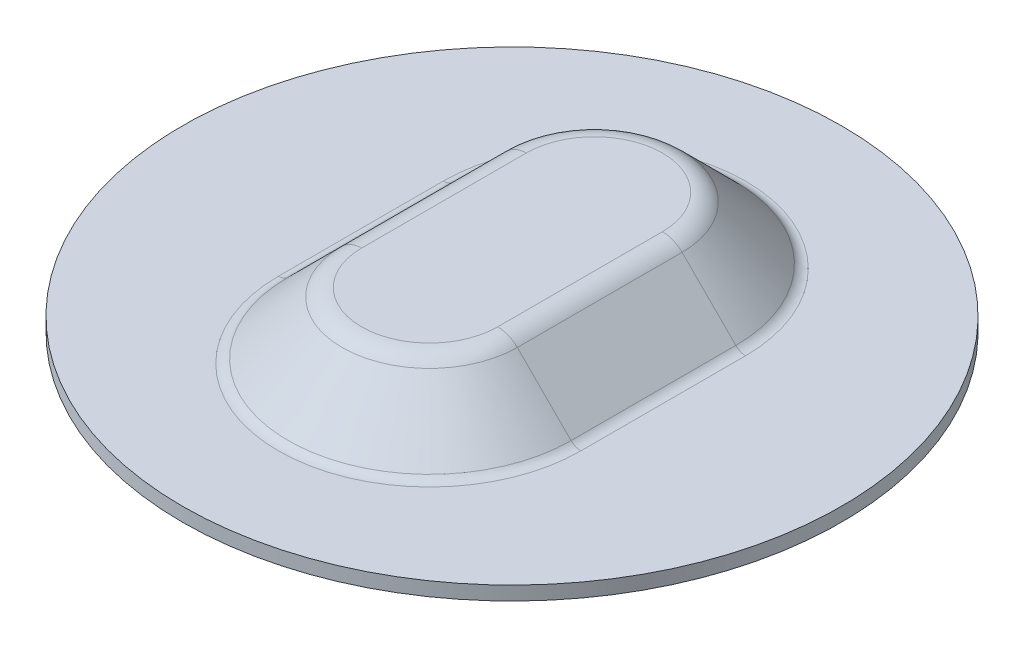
ISO-10303-21;
HEADER;
FILE_DESCRIPTION(('STEP AP214'),'2;1');
FILE_NAME('part.step','',(''),(''),'','','');
FILE_SCHEMA(('AUTOMOTIVE_DESIGN { 1 0 10303 214 1 1 1 1 }'));
ENDSEC;
DATA;
#1=APPLICATION_CONTEXT('core data for automotive mechanical design processes');
#2=APPLICATION_PROTOCOL_DEFINITION('international standard','automotive_design',2000,#1);
#3=PRODUCT_CONTEXT('',#1,'mechanical');
#4=PRODUCT('Part','Part','',(#3));
#5=PRODUCT_RELATED_PRODUCT_CATEGORY('part','',(#4));
#6=PRODUCT_DEFINITION_FORMATION('','',#4);
#7=PRODUCT_DEFINITION_CONTEXT('part definition',#1,'design');
#8=PRODUCT_DEFINITION('design','',#6,#7);
#9=PRODUCT_DEFINITION_SHAPE('','',#8);
#10=(LENGTH_UNIT() NAMED_UNIT(*) SI_UNIT(.MILLI.,.METRE.));
#11=(NAMED_UNIT(*) PLANE_ANGLE_UNIT() SI_UNIT($,.RADIAN.));
#12=(NAMED_UNIT(*) SI_UNIT($,.STERADIAN.) SOLID_ANGLE_UNIT());
#13=UNCERTAINTY_MEASURE_WITH_UNIT(LENGTH_MEASURE(1.E-05),#10,'distance_accuracy_value','');
#14=(GEOMETRIC_REPRESENTATION_CONTEXT(3) GLOBAL_UNCERTAINTY_ASSIGNED_CONTEXT((#13)) GLOBAL_UNIT_ASSIGNED_CONTEXT((#10,
#11,#12)) REPRESENTATION_CONTEXT('',''));
#15=CARTESIAN_POINT('',(0.,0.,0.));
#16=DIRECTION('',(0.,0.,1.));
#17=DIRECTION('',(1.,0.,0.));
#18=AXIS2_PLACEMENT_3D('',#15,#16,#17);
#19=CARTESIAN_POINT('',(0.,0.,-1.53409001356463));
#20=DIRECTION('',(0.,1.,0.));
#21=DIRECTION('',(0.,0.,1.));
#22=AXIS2_PLACEMENT_3D('',#19,#20,#21);
#23=PLANE('',#22);
#24=CARTESIAN_POINT('',(0.,0.,-1.53409001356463));
#25=DIRECTION('',(0.,-1.,0.));
#26=DIRECTION('',(1.,0.,0.));
#27=AXIS2_PLACEMENT_3D('',#24,#25,#26);
#28=CIRCLE('',#27,5.25033394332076);
#29=CARTESIAN_POINT('',(5.25033394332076,0.,-1.53409001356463));
#30=VERTEX_POINT('',#29);
#31=CARTESIAN_POINT('',(0.,0.,3.71624392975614));
#32=VERTEX_POINT('',#31);
#33=EDGE_CURVE('E160',#30,#32,#28,.T.);
#34=ORIENTED_EDGE('',*,*,#33,.F.);
#35=DIRECTION('',(0.,0.,-1.));
#36=VECTOR('',#35,1.);
#37=CARTESIAN_POINT('',(5.25033394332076,0.,-1.53409001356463));
#38=LINE('',#37,#36);
#39=CARTESIAN_POINT('',(5.25033394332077,0.,-14.2340900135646));
#40=VERTEX_POINT('',#39);
#41=EDGE_CURVE('E158',#40,#30,#38,.F.);
#42=ORIENTED_EDGE('',*,*,#41,.F.);
#43=CARTESIAN_POINT('',(0.,0.,-14.2340900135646));
#44=DIRECTION('',(0.,-1.,0.));
#45=DIRECTION('',(-1.,0.,0.));
#46=AXIS2_PLACEMENT_3D('',#43,#44,#45);
#47=CIRCLE('',#46,5.25033394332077);
#48=CARTESIAN_POINT('',(-5.25033394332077,0.,-14.2340900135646));
#49=VERTEX_POINT('',#48);
#50=EDGE_CURVE('E143',#49,#40,#47,.T.);
#51=ORIENTED_EDGE('',*,*,#50,.F.);
#52=DIRECTION('',(0.,0.,1.));
#53=VECTOR('',#52,1.);
#54=CARTESIAN_POINT('',(-5.25033394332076,0.,-1.53409001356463));
#55=LINE('',#54,#53);
#56=CARTESIAN_POINT('',(-5.25033394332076,0.,-1.53409001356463));
#57=VERTEX_POINT('',#56);
#58=EDGE_CURVE('E202',#57,#49,#55,.F.);
#59=ORIENTED_EDGE('',*,*,#58,.F.);
#60=CARTESIAN_POINT('',(0.,0.,-1.53409001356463));
#61=DIRECTION('',(0.,-1.,0.));
#62=DIRECTION('',(0.,0.,1.));
#63=AXIS2_PLACEMENT_3D('',#60,#61,#62);
#64=CIRCLE('',#63,5.25033394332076);
#65=EDGE_CURVE('E208',#32,#57,#64,.T.);
#66=ORIENTED_EDGE('',*,*,#65,.F.);
#67=EDGE_LOOP('',(#34,#42,#51,#59,#66));
#68=FACE_BOUND('',#67,.T.);
#69=ADVANCED_FACE('F18',(#68),#23,.T.);
#70=CARTESIAN_POINT('',(0.,-2.1336,-14.2340900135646));
#71=DIRECTION('',(0.,1.,0.));
#72=DIRECTION('',(0.,0.,1.));
#73=AXIS2_PLACEMENT_3D('',#70,#71,#72);
#74=TOROIDAL_SURFACE('',#73,5.25033394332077,2.1336);
#75=CARTESIAN_POINT('',(-5.25033394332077,-2.1336,-14.2340900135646));
#76=DIRECTION('',(0.,0.,1.));
#77=DIRECTION('',(1.,0.,0.));
#78=AXIS2_PLACEMENT_3D('',#75,#76,#77);
#79=CIRCLE('',#78,2.1336);
#80=CARTESIAN_POINT('',(-6.75901697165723,-0.624916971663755,-14.2340900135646));
#81=VERTEX_POINT('',#80);
#82=EDGE_CURVE('E151',#49,#81,#79,.T.);
#83=ORIENTED_EDGE('',*,*,#82,.F.);
#84=ORIENTED_EDGE('',*,*,#50,.T.);
#85=CARTESIAN_POINT('',(5.25033394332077,-2.1336,-14.2340900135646));
#86=DIRECTION('',(0.,0.,-1.));
#87=DIRECTION('',(-1.,0.,0.));
#88=AXIS2_PLACEMENT_3D('',#85,#86,#87);
#89=CIRCLE('',#88,2.1336);
#90=CARTESIAN_POINT('',(6.75901697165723,-0.624916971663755,-14.2340900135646));
#91=VERTEX_POINT('',#90);
#92=EDGE_CURVE('E148',#91,#40,#89,.F.);
#93=ORIENTED_EDGE('',*,*,#92,.F.);
#94=CARTESIAN_POINT('',(0.,-0.624916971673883,-14.2340900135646));
#95=DIRECTION('',(0.,-1.,0.));
#96=DIRECTION('',(0.,0.,1.));
#97=AXIS2_PLACEMENT_3D('',#94,#95,#96);
#98=CIRCLE('',#97,6.75901697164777);
#99=EDGE_CURVE('E165',#81,#91,#98,.T.);
#100=ORIENTED_EDGE('',*,*,#99,.F.);
#101=EDGE_LOOP('',(#83,#84,#93,#100));
#102=FACE_BOUND('',#101,.T.);
#103=ADVANCED_FACE('F146',(#102),#74,.T.);
#104=CARTESIAN_POINT('',(-5.25033394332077,-2.1336,-1.53409001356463));
#105=DIRECTION('',(0.,0.,1.));
#106=DIRECTION('',(1.,0.,0.));
#107=AXIS2_PLACEMENT_3D('',#104,#105,#106);
#108=CYLINDRICAL_SURFACE('',#107,2.1336);
#109=CARTESIAN_POINT('',(-5.25033394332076,-2.1336,-1.53409001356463));
#110=DIRECTION('',(0.,0.,1.));
#111=DIRECTION('',(-1.,0.,0.));
#112=AXIS2_PLACEMENT_3D('',#109,#110,#111);
#113=CIRCLE('',#112,2.1336);
#114=CARTESIAN_POINT('',(-6.75901697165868,-0.624916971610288,-1.53409001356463));
#115=VERTEX_POINT('',#114);
#116=EDGE_CURVE('E213',#57,#115,#113,.T.);
#117=ORIENTED_EDGE('',*,*,#116,.F.);
#118=ORIENTED_EDGE('',*,*,#58,.T.);
#119=ORIENTED_EDGE('',*,*,#82,.T.);
#120=DIRECTION('',(0.,0.,1.));
#121=VECTOR('',#120,1.);
#122=CARTESIAN_POINT('',(-6.75901697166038,-0.624916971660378,-14.2340900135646));
#123=LINE('',#122,#121);
#124=EDGE_CURVE('E181',#115,#81,#123,.F.);
#125=ORIENTED_EDGE('',*,*,#124,.F.);
#126=EDGE_LOOP('',(#117,#118,#119,#125));
#127=FACE_BOUND('',#126,.T.);
#128=ADVANCED_FACE('F192',(#127),#108,.T.);
#129=CARTESIAN_POINT('',(0.,-2.1336,-1.53409001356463));
#130=DIRECTION('',(0.,1.,0.));
#131=DIRECTION('',(0.,0.,1.));
#132=AXIS2_PLACEMENT_3D('',#129,#130,#131);
#133=TOROIDAL_SURFACE('',#132,5.25033394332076,2.1336);
#134=CARTESIAN_POINT('',(5.25033394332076,-2.1336,-1.53409001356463));
#135=DIRECTION('',(0.,0.,-1.));
#136=DIRECTION('',(-1.,0.,0.));
#137=AXIS2_PLACEMENT_3D('',#134,#135,#136);
#138=CIRCLE('',#137,2.1336);
#139=CARTESIAN_POINT('',(6.75901697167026,-0.624916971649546,-1.53409001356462));
#140=VERTEX_POINT('',#139);
#141=EDGE_CURVE('E172',#30,#140,#138,.T.);
#142=ORIENTED_EDGE('',*,*,#141,.F.);
#143=ORIENTED_EDGE('',*,*,#33,.T.);
#144=ORIENTED_EDGE('',*,*,#65,.T.);
#145=ORIENTED_EDGE('',*,*,#116,.T.);
#146=CARTESIAN_POINT('',(0.,-0.62491697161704,-1.53409001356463));
#147=DIRECTION('',(0.,-1.,0.));
#148=DIRECTION('',(0.,0.,1.));
#149=AXIS2_PLACEMENT_3D('',#146,#147,#148);
#150=CIRCLE('',#149,6.75901697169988);
#151=EDGE_CURVE('E502',#140,#115,#150,.T.);
#152=ORIENTED_EDGE('',*,*,#151,.F.);
#153=EDGE_LOOP('',(#142,#143,#144,#145,#152));
#154=FACE_BOUND('',#153,.T.);
#155=ADVANCED_FACE('F187',(#154),#133,.T.);
#156=CARTESIAN_POINT('',(5.25033394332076,-2.1336,-1.53409001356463));
#157=DIRECTION('',(0.,0.,-1.));
#158=DIRECTION('',(-1.,0.,0.));
#159=AXIS2_PLACEMENT_3D('',#156,#157,#158);
#160=CYLINDRICAL_SURFACE('',#159,2.1336);
#161=ORIENTED_EDGE('',*,*,#92,.T.);
#162=ORIENTED_EDGE('',*,*,#41,.T.);
#163=ORIENTED_EDGE('',*,*,#141,.T.);
#164=DIRECTION('',(0.,0.,1.));
#165=VECTOR('',#164,1.);
#166=CARTESIAN_POINT('',(6.75901697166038,-0.62491697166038,-14.2340900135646));
#167=LINE('',#166,#165);
#168=EDGE_CURVE('E170',#91,#140,#167,.T.);
#169=ORIENTED_EDGE('',*,*,#168,.F.);
#170=EDGE_LOOP('',(#161,#162,#163,#169));
#171=FACE_BOUND('',#170,.T.);
#172=ADVANCED_FACE('F168',(#171),#160,.T.);
#173=CARTESIAN_POINT('',(0.,-1.0668,-1.53409001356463));
#174=DIRECTION('',(0.,1.,0.));
#175=DIRECTION('',(0.,0.,1.));
#176=AXIS2_PLACEMENT_3D('',#173,#174,#175);
#177=PLANE('',#176);
#178=DIRECTION('',(0.,0.,-1.));
#179=VECTOR('',#178,1.);
#180=CARTESIAN_POINT('',(5.25033394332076,-1.0668,-1.53409001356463));
#181=LINE('',#180,#179);
#182=CARTESIAN_POINT('',(5.25033394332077,-1.0668,-14.2340900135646));
#183=VERTEX_POINT('',#182);
#184=CARTESIAN_POINT('',(5.25033394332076,-1.0668,-1.53409001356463));
#185=VERTEX_POINT('',#184);
#186=EDGE_CURVE('E545',#183,#185,#181,.F.);
#187=ORIENTED_EDGE('',*,*,#186,.T.);
#188=CARTESIAN_POINT('',(0.,-1.0668,-1.53409001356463));
#189=DIRECTION('',(0.,1.,0.));
#190=DIRECTION('',(0.,0.,1.));
#191=AXIS2_PLACEMENT_3D('',#188,#189,#190);
#192=CIRCLE('',#191,5.25033394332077);
#193=CARTESIAN_POINT('',(0.,-1.0668,3.71624392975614));
#194=VERTEX_POINT('',#193);
#195=EDGE_CURVE('E592',#185,#194,#192,.F.);
#196=ORIENTED_EDGE('',*,*,#195,.T.);
#197=CARTESIAN_POINT('',(0.,-1.0668,-1.53409001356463));
#198=DIRECTION('',(0.,1.,0.));
#199=DIRECTION('',(-1.,0.,0.));
#200=AXIS2_PLACEMENT_3D('',#197,#198,#199);
#201=CIRCLE('',#200,5.25033394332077);
#202=CARTESIAN_POINT('',(-5.25033394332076,-1.0668,-1.53409001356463));
#203=VERTEX_POINT('',#202);
#204=EDGE_CURVE('E458',#194,#203,#201,.F.);
#205=ORIENTED_EDGE('',*,*,#204,.T.);
#206=DIRECTION('',(0.,0.,1.));
#207=VECTOR('',#206,1.);
#208=CARTESIAN_POINT('',(-5.25033394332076,-1.0668,-1.53409001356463));
#209=LINE('',#208,#207);
#210=CARTESIAN_POINT('',(-5.25033394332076,-1.0668,-14.2340900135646));
#211=VERTEX_POINT('',#210);
#212=EDGE_CURVE('E547',#203,#211,#209,.F.);
#213=ORIENTED_EDGE('',*,*,#212,.T.);
#214=CARTESIAN_POINT('',(0.,-1.0668,-14.2340900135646));
#215=DIRECTION('',(0.,1.,0.));
#216=DIRECTION('',(1.,0.,0.));
#217=AXIS2_PLACEMENT_3D('',#214,#215,#216);
#218=CIRCLE('',#217,5.25033394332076);
#219=EDGE_CURVE('E543',#211,#183,#218,.F.);
#220=ORIENTED_EDGE('',*,*,#219,.T.);
#221=EDGE_LOOP('',(#187,#196,#205,#213,#220));
#222=FACE_BOUND('',#221,.T.);
#223=ADVANCED_FACE('F517',(#222),#177,.F.);
#224=CARTESIAN_POINT('',(0.,-4.76754151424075,-14.2340900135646));
#225=DIRECTION('',(0.,-1.,0.));
#226=DIRECTION('',(0.,0.,-1.));
#227=AXIS2_PLACEMENT_3D('',#224,#225,#226);
#228=CONICAL_SURFACE('',#227,10.9016415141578,0.785398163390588);
#229=DIRECTION('',(-0.707106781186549,0.707106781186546,0.));
#230=VECTOR('',#229,1.);
#231=CARTESIAN_POINT('',(6.1341,0.,-14.2340900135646));
#232=LINE('',#231,#230);
#233=CARTESIAN_POINT('',(10.9016415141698,-4.76754151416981,-14.2340900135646));
#234=VERTEX_POINT('',#233);
#235=EDGE_CURVE('E576',#234,#91,#232,.T.);
#236=ORIENTED_EDGE('',*,*,#235,.F.);
#237=CARTESIAN_POINT('',(0.,-4.76754151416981,-14.2340900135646));
#238=DIRECTION('',(0.,-1.,0.));
#239=DIRECTION('',(0.,0.,-1.));
#240=AXIS2_PLACEMENT_3D('',#237,#238,#239);
#241=CIRCLE('',#240,10.9016415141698);
#242=CARTESIAN_POINT('',(-10.9016415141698,-4.76754151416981,-14.2340900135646));
#243=VERTEX_POINT('',#242);
#244=EDGE_CURVE('E588',#234,#243,#241,.F.);
#245=ORIENTED_EDGE('',*,*,#244,.T.);
#246=DIRECTION('',(-0.707106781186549,-0.707106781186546,0.));
#247=VECTOR('',#246,1.);
#248=CARTESIAN_POINT('',(-6.1341,0.,-14.2340900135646));
#249=LINE('',#248,#247);
#250=EDGE_CURVE('E497',#81,#243,#249,.T.);
#251=ORIENTED_EDGE('',*,*,#250,.F.);
#252=ORIENTED_EDGE('',*,*,#99,.T.);
#253=EDGE_LOOP('',(#236,#245,#251,#252));
#254=FACE_BOUND('',#253,.T.);
#255=ADVANCED_FACE('F526',(#254),#228,.T.);
#256=CARTESIAN_POINT('',(-6.1341,0.,-14.2340900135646));
#257=DIRECTION('',(-0.707106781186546,0.707106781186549,0.));
#258=DIRECTION('',(-0.707106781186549,-0.707106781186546,0.));
#259=AXIS2_PLACEMENT_3D('',#256,#257,#258);
#260=PLANE('',#259);
#261=ORIENTED_EDGE('',*,*,#250,.T.);
#262=DIRECTION('',(0.,0.,1.));
#263=VECTOR('',#262,1.);
#264=CARTESIAN_POINT('',(-10.9016415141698,-4.76754151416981,-14.2340900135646));
#265=LINE('',#264,#263);
#266=CARTESIAN_POINT('',(-10.9016415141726,-4.76754151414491,-1.53409001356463));
#267=VERTEX_POINT('',#266);
#268=EDGE_CURVE('E426',#243,#267,#265,.T.);
#269=ORIENTED_EDGE('',*,*,#268,.T.);
#270=DIRECTION('',(0.707106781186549,0.707106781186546,0.));
#271=VECTOR('',#270,1.);
#272=CARTESIAN_POINT('',(-499001.534090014,-498995.399990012,-1.53409001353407));
#273=LINE('',#272,#271);
#274=EDGE_CURVE('E498',#115,#267,#273,.F.);
#275=ORIENTED_EDGE('',*,*,#274,.F.);
#276=ORIENTED_EDGE('',*,*,#124,.T.);
#277=EDGE_LOOP('',(#261,#269,#275,#276));
#278=FACE_BOUND('',#277,.T.);
#279=ADVANCED_FACE('F739',(#278),#260,.T.);
#280=CARTESIAN_POINT('',(0.,-4.76754151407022,-1.53409001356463));
#281=DIRECTION('',(0.,-1.,0.));
#282=DIRECTION('',(0.,0.,-1.));
#283=AXIS2_PLACEMENT_3D('',#280,#281,#282);
#284=CONICAL_SURFACE('',#283,10.9016415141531,0.785398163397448);
#285=CARTESIAN_POINT('',(0.,-4.76754151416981,-1.53409001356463));
#286=DIRECTION('',(0.,-1.,0.));
#287=DIRECTION('',(0.,0.,-1.));
#288=AXIS2_PLACEMENT_3D('',#285,#286,#287);
#289=CIRCLE('',#288,10.9016415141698);
#290=CARTESIAN_POINT('',(10.9016415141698,-4.76754151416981,-1.53409001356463));
#291=VERTEX_POINT('',#290);
#292=EDGE_CURVE('E420',#267,#291,#289,.F.);
#293=ORIENTED_EDGE('',*,*,#292,.T.);
#294=DIRECTION('',(-0.707106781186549,0.707106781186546,0.));
#295=VECTOR('',#294,1.);
#296=CARTESIAN_POINT('',(6.1341,0.,-1.53409001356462));
#297=LINE('',#296,#295);
#298=EDGE_CURVE('E558',#140,#291,#297,.F.);
#299=ORIENTED_EDGE('',*,*,#298,.F.);
#300=ORIENTED_EDGE('',*,*,#151,.T.);
#301=ORIENTED_EDGE('',*,*,#274,.T.);
#302=EDGE_LOOP('',(#293,#299,#300,#301));
#303=FACE_BOUND('',#302,.T.);
#304=ADVANCED_FACE('F736',(#303),#284,.T.);
#305=CARTESIAN_POINT('',(6.1341,0.,-14.2340900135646));
#306=DIRECTION('',(0.707106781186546,0.707106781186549,0.));
#307=DIRECTION('',(-0.707106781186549,0.707106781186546,0.));
#308=AXIS2_PLACEMENT_3D('',#305,#306,#307);
#309=PLANE('',#308);
#310=ORIENTED_EDGE('',*,*,#298,.T.);
#311=DIRECTION('',(0.,0.,-1.));
#312=VECTOR('',#311,1.);
#313=CARTESIAN_POINT('',(10.9016415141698,-4.76754151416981,-14.2340900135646));
#314=LINE('',#313,#312);
#315=EDGE_CURVE('E387',#291,#234,#314,.T.);
#316=ORIENTED_EDGE('',*,*,#315,.T.);
#317=ORIENTED_EDGE('',*,*,#235,.T.);
#318=ORIENTED_EDGE('',*,*,#168,.T.);
#319=EDGE_LOOP('',(#310,#316,#317,#318));
#320=FACE_BOUND('',#319,.T.);
#321=ADVANCED_FACE('F733',(#320),#309,.T.);
#322=CARTESIAN_POINT('',(5.25033394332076,-2.1336,-1.53409001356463));
#323=DIRECTION('',(0.,0.,-1.));
#324=DIRECTION('',(-1.,0.,0.));
#325=AXIS2_PLACEMENT_3D('',#322,#323,#324);
#326=CYLINDRICAL_SURFACE('',#325,1.0668);
#327=ORIENTED_EDGE('',*,*,#186,.F.);
#328=CARTESIAN_POINT('',(5.25033394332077,-2.1336,-14.2340900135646));
#329=DIRECTION('',(0.,0.,-1.));
#330=DIRECTION('',(1.,0.,0.));
#331=AXIS2_PLACEMENT_3D('',#328,#329,#330);
#332=CIRCLE('',#331,1.0668);
#333=CARTESIAN_POINT('',(6.00467545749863,-1.37925848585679,-14.2340900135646));
#334=VERTEX_POINT('',#333);
#335=EDGE_CURVE('E552',#183,#334,#332,.T.);
#336=ORIENTED_EDGE('',*,*,#335,.T.);
#337=DIRECTION('',(0.,0.,1.));
#338=VECTOR('',#337,1.);
#339=CARTESIAN_POINT('',(6.00467545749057,-1.37925848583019,-14.2340900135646));
#340=LINE('',#339,#338);
#341=CARTESIAN_POINT('',(6.00467545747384,-1.37925848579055,-1.53409001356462));
#342=VERTEX_POINT('',#341);
#343=EDGE_CURVE('E393',#334,#342,#340,.T.);
#344=ORIENTED_EDGE('',*,*,#343,.T.);
#345=CARTESIAN_POINT('',(5.25033394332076,-2.1336,-1.53409001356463));
#346=DIRECTION('',(0.,0.,-1.));
#347=DIRECTION('',(1.,0.,0.));
#348=AXIS2_PLACEMENT_3D('',#345,#346,#347);
#349=CIRCLE('',#348,1.0668);
#350=EDGE_CURVE('E557',#342,#185,#349,.F.);
#351=ORIENTED_EDGE('',*,*,#350,.T.);
#352=EDGE_LOOP('',(#327,#336,#344,#351));
#353=FACE_BOUND('',#352,.T.);
#354=ADVANCED_FACE('F554',(#353),#326,.F.);
#355=CARTESIAN_POINT('',(0.,-2.1336,-14.2340900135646));
#356=DIRECTION('',(0.,1.,0.));
#357=DIRECTION('',(0.,0.,1.));
#358=AXIS2_PLACEMENT_3D('',#355,#356,#357);
#359=TOROIDAL_SURFACE('',#358,5.25033394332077,1.0668);
#360=ORIENTED_EDGE('',*,*,#219,.F.);
#361=CARTESIAN_POINT('',(-5.25033394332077,-2.1336,-14.2340900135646));
#362=DIRECTION('',(0.,0.,1.));
#363=DIRECTION('',(1.,0.,0.));
#364=AXIS2_PLACEMENT_3D('',#361,#362,#363);
#365=CIRCLE('',#364,1.0668);
#366=CARTESIAN_POINT('',(-6.00467545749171,-1.37925848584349,-14.2340900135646));
#367=VERTEX_POINT('',#366);
#368=EDGE_CURVE('E564',#211,#367,#365,.T.);
#369=ORIENTED_EDGE('',*,*,#368,.T.);
#370=CARTESIAN_POINT('',(0.,-1.37925848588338,-14.2340900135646));
#371=DIRECTION('',(0.,-1.,0.));
#372=DIRECTION('',(0.,0.,1.));
#373=AXIS2_PLACEMENT_3D('',#370,#371,#372);
#374=CIRCLE('',#373,6.00467545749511);
#375=EDGE_CURVE('E381',#367,#334,#374,.T.);
#376=ORIENTED_EDGE('',*,*,#375,.T.);
#377=ORIENTED_EDGE('',*,*,#335,.F.);
#378=EDGE_LOOP('',(#360,#369,#376,#377));
#379=FACE_BOUND('',#378,.T.);
#380=ADVANCED_FACE('F560',(#379),#359,.F.);
#381=CARTESIAN_POINT('',(-5.25033394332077,-2.1336,-1.53409001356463));
#382=DIRECTION('',(0.,0.,1.));
#383=DIRECTION('',(1.,0.,0.));
#384=AXIS2_PLACEMENT_3D('',#381,#382,#383);
#385=CYLINDRICAL_SURFACE('',#384,1.0668);
#386=ORIENTED_EDGE('',*,*,#212,.F.);
#387=CARTESIAN_POINT('',(-5.25033394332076,-2.1336,-1.53409001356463));
#388=DIRECTION('',(0.,0.,1.));
#389=DIRECTION('',(-1.,0.,0.));
#390=AXIS2_PLACEMENT_3D('',#387,#388,#389);
#391=CIRCLE('',#390,1.0668);
#392=CARTESIAN_POINT('',(-6.00467545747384,-1.37925848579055,-1.53409001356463));
#393=VERTEX_POINT('',#392);
#394=EDGE_CURVE('E595',#203,#393,#391,.T.);
#395=ORIENTED_EDGE('',*,*,#394,.T.);
#396=DIRECTION('',(0.,0.,1.));
#397=VECTOR('',#396,1.);
#398=CARTESIAN_POINT('',(-6.00467545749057,-1.37925848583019,-14.2340900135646));
#399=LINE('',#398,#397);
#400=EDGE_CURVE('E371',#393,#367,#399,.F.);
#401=ORIENTED_EDGE('',*,*,#400,.T.);
#402=ORIENTED_EDGE('',*,*,#368,.F.);
#403=EDGE_LOOP('',(#386,#395,#401,#402));
#404=FACE_BOUND('',#403,.T.);
#405=ADVANCED_FACE('F619',(#404),#385,.F.);
#406=CARTESIAN_POINT('',(0.,-2.1336,-1.53409001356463));
#407=DIRECTION('',(0.,1.,0.));
#408=DIRECTION('',(0.,0.,1.));
#409=AXIS2_PLACEMENT_3D('',#406,#407,#408);
#410=TOROIDAL_SURFACE('',#409,5.25033394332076,1.0668);
#411=CARTESIAN_POINT('',(0.,-1.37925848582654,-1.53409001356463));
#412=DIRECTION('',(0.,-1.,0.));
#413=DIRECTION('',(0.,0.,1.));
#414=AXIS2_PLACEMENT_3D('',#411,#412,#413);
#415=CIRCLE('',#414,6.00467545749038);
#416=EDGE_CURVE('E356',#342,#393,#415,.T.);
#417=ORIENTED_EDGE('',*,*,#416,.T.);
#418=ORIENTED_EDGE('',*,*,#394,.F.);
#419=ORIENTED_EDGE('',*,*,#204,.F.);
#420=ORIENTED_EDGE('',*,*,#195,.F.);
#421=ORIENTED_EDGE('',*,*,#350,.F.);
#422=EDGE_LOOP('',(#417,#418,#419,#420,#421));
#423=FACE_BOUND('',#422,.T.);
#424=ADVANCED_FACE('F436',(#423),#410,.F.);
#425=CARTESIAN_POINT('',(0.,-4.0132,-14.2340900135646));
#426=DIRECTION('',(0.,-1.,0.));
#427=DIRECTION('',(0.,0.,-1.));
#428=AXIS2_PLACEMENT_3D('',#425,#426,#427);
#429=TOROIDAL_SURFACE('',#428,11.6559830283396,1.0668);
#430=CARTESIAN_POINT('',(0.,-5.08,-14.2340900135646));
#431=DIRECTION('',(0.,1.,0.));
#432=DIRECTION('',(0.,0.,-1.));
#433=AXIS2_PLACEMENT_3D('',#430,#431,#432);
#434=CIRCLE('',#433,11.6559830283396);
#435=CARTESIAN_POINT('',(0.,-5.08,-25.8900730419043));
#436=VERTEX_POINT('',#435);
#437=CARTESIAN_POINT('',(-11.6559830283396,-5.08,-14.2340900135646));
#438=VERTEX_POINT('',#437);
#439=EDGE_CURVE('E341',#436,#438,#434,.T.);
#440=ORIENTED_EDGE('',*,*,#439,.T.);
#441=CARTESIAN_POINT('',(-11.6559830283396,-4.0132,-14.2340900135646));
#442=DIRECTION('',(0.,0.,1.));
#443=DIRECTION('',(1.,0.,0.));
#444=AXIS2_PLACEMENT_3D('',#441,#442,#443);
#445=CIRCLE('',#444,1.0668);
#446=EDGE_CURVE('E423',#438,#243,#445,.T.);
#447=ORIENTED_EDGE('',*,*,#446,.T.);
#448=ORIENTED_EDGE('',*,*,#244,.F.);
#449=CARTESIAN_POINT('',(11.6559830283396,-4.0132,-14.2340900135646));
#450=DIRECTION('',(0.,0.,-1.));
#451=DIRECTION('',(-1.,0.,0.));
#452=AXIS2_PLACEMENT_3D('',#449,#450,#451);
#453=CIRCLE('',#452,1.0668);
#454=CARTESIAN_POINT('',(11.6559830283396,-5.08,-14.2340900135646));
#455=VERTEX_POINT('',#454);
#456=EDGE_CURVE('E391',#234,#455,#453,.F.);
#457=ORIENTED_EDGE('',*,*,#456,.T.);
#458=CARTESIAN_POINT('',(0.,-5.08,-14.2340900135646));
#459=DIRECTION('',(0.,1.,0.));
#460=DIRECTION('',(1.,0.,0.));
#461=AXIS2_PLACEMENT_3D('',#458,#459,#460);
#462=CIRCLE('',#461,11.6559830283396);
#463=EDGE_CURVE('E295',#455,#436,#462,.T.);
#464=ORIENTED_EDGE('',*,*,#463,.T.);
#465=EDGE_LOOP('',(#440,#447,#448,#457,#464));
#466=FACE_BOUND('',#465,.T.);
#467=ADVANCED_FACE('F432',(#466),#429,.F.);
#468=CARTESIAN_POINT('',(-11.6559830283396,-4.0132,-14.2340900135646));
#469=DIRECTION('',(0.,0.,1.));
#470=DIRECTION('',(1.,0.,0.));
#471=AXIS2_PLACEMENT_3D('',#468,#469,#470);
#472=CYLINDRICAL_SURFACE('',#471,1.0668);
#473=DIRECTION('',(0.,0.,-1.));
#474=VECTOR('',#473,1.);
#475=CARTESIAN_POINT('',(-11.6559830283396,-5.08,-7.88409001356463));
#476=LINE('',#475,#474);
#477=CARTESIAN_POINT('',(-11.6559830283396,-5.08,-1.53409001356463));
#478=VERTEX_POINT('',#477);
#479=EDGE_CURVE('E339',#438,#478,#476,.F.);
#480=ORIENTED_EDGE('',*,*,#479,.T.);
#481=CARTESIAN_POINT('',(-11.6559830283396,-4.0132,-1.53409001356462));
#482=DIRECTION('',(0.,0.,-1.));
#483=DIRECTION('',(-1.,0.,0.));
#484=AXIS2_PLACEMENT_3D('',#481,#482,#483);
#485=CIRCLE('',#484,1.0668);
#486=EDGE_CURVE('E388',#478,#267,#485,.F.);
#487=ORIENTED_EDGE('',*,*,#486,.T.);
#488=ORIENTED_EDGE('',*,*,#268,.F.);
#489=ORIENTED_EDGE('',*,*,#446,.F.);
#490=EDGE_LOOP('',(#480,#487,#488,#489));
#491=FACE_BOUND('',#490,.T.);
#492=ADVANCED_FACE('F406',(#491),#472,.F.);
#493=CARTESIAN_POINT('',(0.,-4.0132,-1.53409001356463));
#494=DIRECTION('',(0.,-1.,0.));
#495=DIRECTION('',(0.,0.,-1.));
#496=AXIS2_PLACEMENT_3D('',#493,#494,#495);
#497=TOROIDAL_SURFACE('',#496,11.6559830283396,1.0668);
#498=CARTESIAN_POINT('',(0.,-5.08,-1.53409001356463));
#499=DIRECTION('',(0.,1.,0.));
#500=DIRECTION('',(-1.,0.,0.));
#501=AXIS2_PLACEMENT_3D('',#498,#499,#500);
#502=CIRCLE('',#501,11.6559830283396);
#503=CARTESIAN_POINT('',(11.6559830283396,-5.08,-1.53409001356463));
#504=VERTEX_POINT('',#503);
#505=EDGE_CURVE('E325',#478,#504,#502,.T.);
#506=ORIENTED_EDGE('',*,*,#505,.T.);
#507=CARTESIAN_POINT('',(11.6559830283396,-4.0132,-1.53409001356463));
#508=DIRECTION('',(0.,0.,-1.));
#509=DIRECTION('',(-1.,0.,0.));
#510=AXIS2_PLACEMENT_3D('',#507,#508,#509);
#511=CIRCLE('',#510,1.0668);
#512=EDGE_CURVE('E384',#504,#291,#511,.T.);
#513=ORIENTED_EDGE('',*,*,#512,.T.);
#514=ORIENTED_EDGE('',*,*,#292,.F.);
#515=ORIENTED_EDGE('',*,*,#486,.F.);
#516=EDGE_LOOP('',(#506,#513,#514,#515));
#517=FACE_BOUND('',#516,.T.);
#518=ADVANCED_FACE('F400',(#517),#497,.F.);
#519=CARTESIAN_POINT('',(11.6559830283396,-4.0132,-14.2340900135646));
#520=DIRECTION('',(0.,0.,-1.));
#521=DIRECTION('',(-1.,0.,0.));
#522=AXIS2_PLACEMENT_3D('',#519,#520,#521);
#523=CYLINDRICAL_SURFACE('',#522,1.0668);
#524=ORIENTED_EDGE('',*,*,#315,.F.);
#525=ORIENTED_EDGE('',*,*,#512,.F.);
#526=DIRECTION('',(0.,0.,-1.));
#527=VECTOR('',#526,1.);
#528=CARTESIAN_POINT('',(11.6559830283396,-5.08,-7.88409001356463));
#529=LINE('',#528,#527);
#530=EDGE_CURVE('E329',#504,#455,#529,.T.);
#531=ORIENTED_EDGE('',*,*,#530,.T.);
#532=ORIENTED_EDGE('',*,*,#456,.F.);
#533=EDGE_LOOP('',(#524,#525,#531,#532));
#534=FACE_BOUND('',#533,.T.);
#535=ADVANCED_FACE('F405',(#534),#523,.F.);
#536=CARTESIAN_POINT('',(5.37975848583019,-0.75434151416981,-14.2340900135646));
#537=DIRECTION('',(0.707106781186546,0.707106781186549,0.));
#538=DIRECTION('',(-0.707106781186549,0.707106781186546,0.));
#539=AXIS2_PLACEMENT_3D('',#536,#537,#538);
#540=PLANE('',#539);
#541=DIRECTION('',(0.,0.,-1.));
#542=VECTOR('',#541,1.);
#543=CARTESIAN_POINT('',(10.1473,-5.52188302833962,-14.2340900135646));
#544=LINE('',#543,#542);
#545=CARTESIAN_POINT('',(10.1473000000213,-5.52188302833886,-1.53409001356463));
#546=VERTEX_POINT('',#545);
#547=CARTESIAN_POINT('',(10.1472999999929,-5.52188302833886,-14.2340900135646));
#548=VERTEX_POINT('',#547);
#549=EDGE_CURVE('E287',#546,#548,#544,.T.);
#550=ORIENTED_EDGE('',*,*,#549,.F.);
#551=DIRECTION('',(-0.707106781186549,0.707106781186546,0.));
#552=VECTOR('',#551,1.);
#553=CARTESIAN_POINT('',(499001.534090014,-498996.90867304,-1.53409001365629));
#554=LINE('',#553,#552);
#555=EDGE_CURVE('E353',#546,#342,#554,.T.);
#556=ORIENTED_EDGE('',*,*,#555,.T.);
#557=ORIENTED_EDGE('',*,*,#343,.F.);
#558=DIRECTION('',(-0.707106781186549,0.707106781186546,0.));
#559=VECTOR('',#558,1.);
#560=CARTESIAN_POINT('',(499004.625416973,-499000.,-14.2340900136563));
#561=LINE('',#560,#559);
#562=EDGE_CURVE('E378',#334,#548,#561,.F.);
#563=ORIENTED_EDGE('',*,*,#562,.T.);
#564=EDGE_LOOP('',(#550,#556,#557,#563));
#565=FACE_BOUND('',#564,.T.);
#566=ADVANCED_FACE('F704',(#565),#540,.F.);
#567=CARTESIAN_POINT('',(0.,-5.52188302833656,-14.2340900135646));
#568=DIRECTION('',(0.,-1.,0.));
#569=DIRECTION('',(0.,0.,-1.));
#570=AXIS2_PLACEMENT_3D('',#567,#568,#569);
#571=CONICAL_SURFACE('',#570,10.1472999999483,0.785398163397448);
#572=CARTESIAN_POINT('',(0.,-5.52188302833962,-14.2340900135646));
#573=DIRECTION('',(0.,-1.,0.));
#574=DIRECTION('',(0.,0.,-1.));
#575=AXIS2_PLACEMENT_3D('',#572,#573,#574);
#576=CIRCLE('',#575,10.1473);
#577=CARTESIAN_POINT('',(-10.1473,-5.52188302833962,-14.2340900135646));
#578=VERTEX_POINT('',#577);
#579=EDGE_CURVE('E286',#548,#578,#576,.F.);
#580=ORIENTED_EDGE('',*,*,#579,.F.);
#581=ORIENTED_EDGE('',*,*,#562,.F.);
#582=ORIENTED_EDGE('',*,*,#375,.F.);
#583=DIRECTION('',(-0.707106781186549,-0.707106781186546,0.));
#584=VECTOR('',#583,1.);
#585=CARTESIAN_POINT('',(-5.37975848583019,-0.75434151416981,-14.2340900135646));
#586=LINE('',#585,#584);
#587=EDGE_CURVE('E362',#367,#578,#586,.T.);
#588=ORIENTED_EDGE('',*,*,#587,.T.);
#589=EDGE_LOOP('',(#580,#581,#582,#588));
#590=FACE_BOUND('',#589,.T.);
#591=ADVANCED_FACE('F625',(#590),#571,.F.);
#592=CARTESIAN_POINT('',(-5.37975848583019,-0.75434151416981,-14.2340900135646));
#593=DIRECTION('',(-0.707106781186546,0.707106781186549,0.));
#594=DIRECTION('',(-0.707106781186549,-0.707106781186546,0.));
#595=AXIS2_PLACEMENT_3D('',#592,#593,#594);
#596=PLANE('',#595);
#597=DIRECTION('',(0.,0.,1.));
#598=VECTOR('',#597,1.);
#599=CARTESIAN_POINT('',(-10.1473,-5.52188302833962,-14.2340900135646));
#600=LINE('',#599,#598);
#601=CARTESIAN_POINT('',(-10.1472999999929,-5.52188302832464,-1.53409001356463));
#602=VERTEX_POINT('',#601);
#603=EDGE_CURVE('E365',#578,#602,#600,.T.);
#604=ORIENTED_EDGE('',*,*,#603,.F.);
#605=ORIENTED_EDGE('',*,*,#587,.F.);
#606=ORIENTED_EDGE('',*,*,#400,.F.);
#607=DIRECTION('',(0.707106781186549,0.707106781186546,0.));
#608=VECTOR('',#607,1.);
#609=CARTESIAN_POINT('',(-499001.534090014,-498996.90867304,-1.53409001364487));
#610=LINE('',#609,#608);
#611=EDGE_CURVE('E357',#393,#602,#610,.F.);
#612=ORIENTED_EDGE('',*,*,#611,.T.);
#613=EDGE_LOOP('',(#604,#605,#606,#612));
#614=FACE_BOUND('',#613,.T.);
#615=ADVANCED_FACE('F627',(#614),#596,.F.);
#616=CARTESIAN_POINT('',(0.,-5.52188302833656,-1.53409001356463));
#617=DIRECTION('',(0.,-1.,0.));
#618=DIRECTION('',(0.,0.,-1.));
#619=AXIS2_PLACEMENT_3D('',#616,#617,#618);
#620=CONICAL_SURFACE('',#619,10.1473000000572,0.785398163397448);
#621=ORIENTED_EDGE('',*,*,#416,.F.);
#622=ORIENTED_EDGE('',*,*,#555,.F.);
#623=CARTESIAN_POINT('',(0.,-5.52188302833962,-1.53409001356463));
#624=DIRECTION('',(0.,-1.,0.));
#625=DIRECTION('',(0.,0.,-1.));
#626=AXIS2_PLACEMENT_3D('',#623,#624,#625);
#627=CIRCLE('',#626,10.1473);
#628=EDGE_CURVE('E348',#602,#546,#627,.F.);
#629=ORIENTED_EDGE('',*,*,#628,.F.);
#630=ORIENTED_EDGE('',*,*,#611,.F.);
#631=EDGE_LOOP('',(#621,#622,#629,#630));
#632=FACE_BOUND('',#631,.T.);
#633=ADVANCED_FACE('F309',(#632),#620,.F.);
#634=CARTESIAN_POINT('',(0.,-5.08,-7.88409001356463));
#635=DIRECTION('',(0.,-1.,0.));
#636=DIRECTION('',(0.,0.,-1.));
#637=AXIS2_PLACEMENT_3D('',#634,#635,#636);
#638=PLANE('',#637);
#639=CARTESIAN_POINT('',(0.,-5.08,-7.88409001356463));
#640=DIRECTION('',(0.,-1.,0.));
#641=DIRECTION('',(0.,0.,-1.));
#642=AXIS2_PLACEMENT_3D('',#639,#640,#641);
#643=CIRCLE('',#642,25.4);
#644=CARTESIAN_POINT('',(0.,-5.08,-33.2840900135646));
#645=VERTEX_POINT('',#644);
#646=EDGE_CURVE('E235',#645,#645,#643,.T.);
#647=ORIENTED_EDGE('',*,*,#646,.F.);
#648=EDGE_LOOP('',(#647));
#649=FACE_BOUND('',#648,.T.);
#650=ORIENTED_EDGE('',*,*,#505,.F.);
#651=ORIENTED_EDGE('',*,*,#479,.F.);
#652=ORIENTED_EDGE('',*,*,#439,.F.);
#653=ORIENTED_EDGE('',*,*,#463,.F.);
#654=ORIENTED_EDGE('',*,*,#530,.F.);
#655=EDGE_LOOP('',(#650,#651,#652,#653,#654));
#656=FACE_BOUND('',#655,.T.);
#657=ADVANCED_FACE('F300',(#649,#656),#638,.F.);
#658=CARTESIAN_POINT('',(11.6559830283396,-4.0132,-14.2340900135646));
#659=DIRECTION('',(0.,0.,-1.));
#660=DIRECTION('',(-1.,0.,0.));
#661=AXIS2_PLACEMENT_3D('',#658,#659,#660);
#662=CYLINDRICAL_SURFACE('',#661,2.1336);
#663=CARTESIAN_POINT('',(11.6559830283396,-4.0132,-1.53409001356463));
#664=DIRECTION('',(0.,0.,1.));
#665=DIRECTION('',(1.,0.,0.));
#666=AXIS2_PLACEMENT_3D('',#663,#664,#665);
#667=CIRCLE('',#666,2.1336);
#668=CARTESIAN_POINT('',(11.6559830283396,-6.1468,-1.53409001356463));
#669=VERTEX_POINT('',#668);
#670=EDGE_CURVE('E239',#546,#669,#667,.T.);
#671=ORIENTED_EDGE('',*,*,#670,.F.);
#672=ORIENTED_EDGE('',*,*,#549,.T.);
#673=CARTESIAN_POINT('',(11.6559830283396,-4.0132,-14.2340900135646));
#674=DIRECTION('',(0.,0.,1.));
#675=DIRECTION('',(1.,0.,0.));
#676=AXIS2_PLACEMENT_3D('',#673,#674,#675);
#677=CIRCLE('',#676,2.1336);
#678=CARTESIAN_POINT('',(11.6559830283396,-6.1468,-14.2340900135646));
#679=VERTEX_POINT('',#678);
#680=EDGE_CURVE('E279',#679,#548,#677,.F.);
#681=ORIENTED_EDGE('',*,*,#680,.F.);
#682=DIRECTION('',(0.,0.,-1.));
#683=VECTOR('',#682,1.);
#684=CARTESIAN_POINT('',(11.6559830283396,-6.1468,-7.88409001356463));
#685=LINE('',#684,#683);
#686=EDGE_CURVE('E238',#669,#679,#685,.T.);
#687=ORIENTED_EDGE('',*,*,#686,.F.);
#688=EDGE_LOOP('',(#671,#672,#681,#687));
#689=FACE_BOUND('',#688,.T.);
#690=ADVANCED_FACE('F264',(#689),#662,.T.);
#691=CARTESIAN_POINT('',(0.,-4.0132,-14.2340900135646));
#692=DIRECTION('',(0.,-1.,0.));
#693=DIRECTION('',(0.,0.,-1.));
#694=AXIS2_PLACEMENT_3D('',#691,#692,#693);
#695=TOROIDAL_SURFACE('',#694,11.6559830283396,2.1336);
#696=ORIENTED_EDGE('',*,*,#579,.T.);
#697=CARTESIAN_POINT('',(-11.6559830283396,-4.0132,-14.2340900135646));
#698=DIRECTION('',(0.,0.,1.));
#699=DIRECTION('',(1.,0.,0.));
#700=AXIS2_PLACEMENT_3D('',#697,#698,#699);
#701=CIRCLE('',#700,2.1336);
#702=CARTESIAN_POINT('',(-11.6559830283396,-6.1468,-14.2340900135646));
#703=VERTEX_POINT('',#702);
#704=EDGE_CURVE('E367',#703,#578,#701,.T.);
#705=ORIENTED_EDGE('',*,*,#704,.F.);
#706=CARTESIAN_POINT('',(0.,-6.1468,-14.2340900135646));
#707=DIRECTION('',(0.,-1.,0.));
#708=DIRECTION('',(-1.,0.,0.));
#709=AXIS2_PLACEMENT_3D('',#706,#707,#708);
#710=CIRCLE('',#709,11.6559830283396);
#711=CARTESIAN_POINT('',(0.,-6.1468,-25.8900730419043));
#712=VERTEX_POINT('',#711);
#713=EDGE_CURVE('E275',#712,#703,#710,.F.);
#714=ORIENTED_EDGE('',*,*,#713,.F.);
#715=CARTESIAN_POINT('',(0.,-6.1468,-14.2340900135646));
#716=DIRECTION('',(0.,-1.,0.));
#717=DIRECTION('',(0.,0.,-1.));
#718=AXIS2_PLACEMENT_3D('',#715,#716,#717);
#719=CIRCLE('',#718,11.6559830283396);
#720=EDGE_CURVE('E245',#679,#712,#719,.F.);
#721=ORIENTED_EDGE('',*,*,#720,.F.);
#722=ORIENTED_EDGE('',*,*,#680,.T.);
#723=EDGE_LOOP('',(#696,#705,#714,#721,#722));
#724=FACE_BOUND('',#723,.T.);
#725=ADVANCED_FACE('F252',(#724),#695,.T.);
#726=CARTESIAN_POINT('',(-11.6559830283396,-4.0132,-14.2340900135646));
#727=DIRECTION('',(0.,0.,1.));
#728=DIRECTION('',(1.,0.,0.));
#729=AXIS2_PLACEMENT_3D('',#726,#727,#728);
#730=CYLINDRICAL_SURFACE('',#729,2.1336);
#731=CARTESIAN_POINT('',(-11.6559830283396,-4.0132,-1.53409001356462));
#732=DIRECTION('',(0.,0.,-1.));
#733=DIRECTION('',(-1.,0.,0.));
#734=AXIS2_PLACEMENT_3D('',#731,#732,#733);
#735=CIRCLE('',#734,2.1336);
#736=CARTESIAN_POINT('',(-11.6559830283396,-6.1468,-1.53409001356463));
#737=VERTEX_POINT('',#736);
#738=EDGE_CURVE('E39',#737,#602,#735,.F.);
#739=ORIENTED_EDGE('',*,*,#738,.F.);
#740=DIRECTION('',(0.,0.,-1.));
#741=VECTOR('',#740,1.);
#742=CARTESIAN_POINT('',(-11.6559830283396,-6.1468,-7.88409001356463));
#743=LINE('',#742,#741);
#744=EDGE_CURVE('E630',#703,#737,#743,.F.);
#745=ORIENTED_EDGE('',*,*,#744,.F.);
#746=ORIENTED_EDGE('',*,*,#704,.T.);
#747=ORIENTED_EDGE('',*,*,#603,.T.);
#748=EDGE_LOOP('',(#739,#745,#746,#747));
#749=FACE_BOUND('',#748,.T.);
#750=ADVANCED_FACE('F263',(#749),#730,.T.);
#751=CARTESIAN_POINT('',(0.,-4.0132,-1.53409001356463));
#752=DIRECTION('',(0.,-1.,0.));
#753=DIRECTION('',(0.,0.,-1.));
#754=AXIS2_PLACEMENT_3D('',#751,#752,#753);
#755=TOROIDAL_SURFACE('',#754,11.6559830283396,2.1336);
#756=ORIENTED_EDGE('',*,*,#670,.T.);
#757=CARTESIAN_POINT('',(0.,-6.1468,-1.53409001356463));
#758=DIRECTION('',(0.,-1.,0.));
#759=DIRECTION('',(1.,0.,0.));
#760=AXIS2_PLACEMENT_3D('',#757,#758,#759);
#761=CIRCLE('',#760,11.6559830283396);
#762=EDGE_CURVE('E30',#737,#669,#761,.F.);
#763=ORIENTED_EDGE('',*,*,#762,.F.);
#764=ORIENTED_EDGE('',*,*,#738,.T.);
#765=ORIENTED_EDGE('',*,*,#628,.T.);
#766=EDGE_LOOP('',(#756,#763,#764,#765));
#767=FACE_BOUND('',#766,.T.);
#768=ADVANCED_FACE('F643',(#767),#755,.T.);
#769=CARTESIAN_POINT('',(0.,-5.08,-7.88409001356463));
#770=DIRECTION('',(0.,-1.,0.));
#771=DIRECTION('',(0.,0.,-1.));
#772=AXIS2_PLACEMENT_3D('',#769,#770,#771);
#773=CYLINDRICAL_SURFACE('',#772,25.4);
#774=ORIENTED_EDGE('',*,*,#646,.T.);
#775=EDGE_LOOP('',(#774));
#776=FACE_BOUND('',#775,.T.);
#777=CARTESIAN_POINT('',(0.,-6.1468,-7.88409001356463));
#778=DIRECTION('',(0.,-1.,0.));
#779=DIRECTION('',(0.,0.,-1.));
#780=AXIS2_PLACEMENT_3D('',#777,#778,#779);
#781=CIRCLE('',#780,25.4);
#782=CARTESIAN_POINT('',(0.,-6.1468,-33.2840900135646));
#783=VERTEX_POINT('',#782);
#784=EDGE_CURVE('E11',#783,#783,#781,.T.);
#785=ORIENTED_EDGE('',*,*,#784,.F.);
#786=EDGE_LOOP('',(#785));
#787=FACE_BOUND('',#786,.T.);
#788=ADVANCED_FACE('F652',(#776,#787),#773,.T.);
#789=CARTESIAN_POINT('',(0.,-6.1468,-7.88409001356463));
#790=DIRECTION('',(0.,-1.,0.));
#791=DIRECTION('',(0.,0.,-1.));
#792=AXIS2_PLACEMENT_3D('',#789,#790,#791);
#793=PLANE('',#792);
#794=ORIENTED_EDGE('',*,*,#784,.T.);
#795=EDGE_LOOP('',(#794));
#796=FACE_BOUND('',#795,.T.);
#797=ORIENTED_EDGE('',*,*,#744,.T.);
#798=ORIENTED_EDGE('',*,*,#762,.T.);
#799=ORIENTED_EDGE('',*,*,#686,.T.);
#800=ORIENTED_EDGE('',*,*,#720,.T.);
#801=ORIENTED_EDGE('',*,*,#713,.T.);
#802=EDGE_LOOP('',(#797,#798,#799,#800,#801));
#803=FACE_BOUND('',#802,.T.);
#804=ADVANCED_FACE('F668',(#796,#803),#793,.T.);
#805=CLOSED_SHELL('',(#69,#103,#128,#155,#172,#223,#255,#279,#304,#321,#354,#380,#405,#424,#467,
#492,#518,#535,#566,#591,#615,#633,#657,#690,#725,#750,#768,#788,#804));
#806=MANIFOLD_SOLID_BREP('B1',#805);
#807=ADVANCED_BREP_SHAPE_REPRESENTATION('',(#18,#806),#14);
#808=SHAPE_DEFINITION_REPRESENTATION(#9,#807);
ENDSEC;
END-ISO-10303-21;
